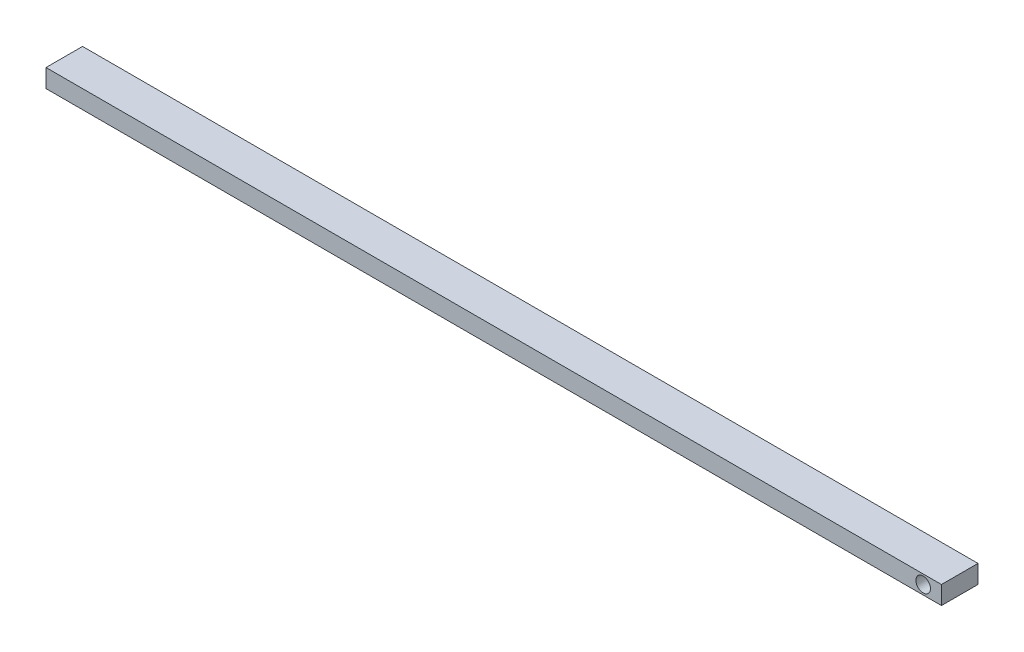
ISO-10303-21;
HEADER;
FILE_DESCRIPTION(('STEP AP214'),'2;1');
FILE_NAME('part.step','',(''),(''),'','','');
FILE_SCHEMA(('AUTOMOTIVE_DESIGN { 1 0 10303 214 1 1 1 1 }'));
ENDSEC;
DATA;
#1=APPLICATION_CONTEXT('core data for automotive mechanical design processes');
#2=APPLICATION_PROTOCOL_DEFINITION('international standard','automotive_design',2000,#1);
#3=PRODUCT_CONTEXT('',#1,'mechanical');
#4=PRODUCT('Part','Part','',(#3));
#5=PRODUCT_RELATED_PRODUCT_CATEGORY('part','',(#4));
#6=PRODUCT_DEFINITION_FORMATION('','',#4);
#7=PRODUCT_DEFINITION_CONTEXT('part definition',#1,'design');
#8=PRODUCT_DEFINITION('design','',#6,#7);
#9=PRODUCT_DEFINITION_SHAPE('','',#8);
#10=(LENGTH_UNIT() NAMED_UNIT(*) SI_UNIT(.MILLI.,.METRE.));
#11=(NAMED_UNIT(*) PLANE_ANGLE_UNIT() SI_UNIT($,.RADIAN.));
#12=(NAMED_UNIT(*) SI_UNIT($,.STERADIAN.) SOLID_ANGLE_UNIT());
#13=UNCERTAINTY_MEASURE_WITH_UNIT(LENGTH_MEASURE(1.E-05),#10,'distance_accuracy_value','');
#14=(GEOMETRIC_REPRESENTATION_CONTEXT(3) GLOBAL_UNCERTAINTY_ASSIGNED_CONTEXT((#13)) GLOBAL_UNIT_ASSIGNED_CONTEXT((#10,
#11,#12)) REPRESENTATION_CONTEXT('',''));
#15=CARTESIAN_POINT('',(0.,0.,0.));
#16=DIRECTION('',(0.,0.,1.));
#17=DIRECTION('',(1.,0.,0.));
#18=AXIS2_PLACEMENT_3D('',#15,#16,#17);
#19=CARTESIAN_POINT('',(0.,0.,20.));
#20=DIRECTION('',(1.,0.,0.));
#21=DIRECTION('',(0.,0.,-1.));
#22=AXIS2_PLACEMENT_3D('',#19,#20,#21);
#23=PLANE('',#22);
#24=CARTESIAN_POINT('',(0.,5.,10.));
#25=DIRECTION('',(-1.,0.,0.));
#26=DIRECTION('',(0.,0.,1.));
#27=AXIS2_PLACEMENT_3D('',#24,#25,#26);
#28=CIRCLE('',#27,4.75);
#29=CARTESIAN_POINT('',(0.,5.,14.75));
#30=VERTEX_POINT('',#29);
#31=EDGE_CURVE('E142',#30,#30,#28,.T.);
#32=ORIENTED_EDGE('',*,*,#31,.F.);
#33=EDGE_LOOP('',(#32));
#34=FACE_BOUND('',#33,.T.);
#35=DIRECTION('',(0.,-1.,0.));
#36=VECTOR('',#35,1.);
#37=CARTESIAN_POINT('',(0.,0.,0.));
#38=LINE('',#37,#36);
#39=CARTESIAN_POINT('',(0.,10.,0.));
#40=VERTEX_POINT('',#39);
#41=CARTESIAN_POINT('',(0.,0.,0.));
#42=VERTEX_POINT('',#41);
#43=EDGE_CURVE('E113',#40,#42,#38,.T.);
#44=ORIENTED_EDGE('',*,*,#43,.T.);
#45=DIRECTION('',(0.,0.,-1.));
#46=VECTOR('',#45,1.);
#47=CARTESIAN_POINT('',(0.,0.,20.));
#48=LINE('',#47,#46);
#49=CARTESIAN_POINT('',(0.,0.,20.));
#50=VERTEX_POINT('',#49);
#51=EDGE_CURVE('E11',#50,#42,#48,.T.);
#52=ORIENTED_EDGE('',*,*,#51,.F.);
#53=DIRECTION('',(0.,-1.,0.));
#54=VECTOR('',#53,1.);
#55=CARTESIAN_POINT('',(0.,0.,20.));
#56=LINE('',#55,#54);
#57=CARTESIAN_POINT('',(0.,10.,20.));
#58=VERTEX_POINT('',#57);
#59=EDGE_CURVE('E97',#58,#50,#56,.T.);
#60=ORIENTED_EDGE('',*,*,#59,.F.);
#61=DIRECTION('',(0.,0.,-1.));
#62=VECTOR('',#61,1.);
#63=CARTESIAN_POINT('',(0.,10.,20.));
#64=LINE('',#63,#62);
#65=EDGE_CURVE('E109',#58,#40,#64,.T.);
#66=ORIENTED_EDGE('',*,*,#65,.T.);
#67=EDGE_LOOP('',(#44,#52,#60,#66));
#68=FACE_BOUND('',#67,.T.);
#69=ADVANCED_FACE('F45',(#34,#68),#23,.F.);
#70=CARTESIAN_POINT('',(0.,0.,20.));
#71=DIRECTION('',(0.,1.,0.));
#72=DIRECTION('',(0.,0.,1.));
#73=AXIS2_PLACEMENT_3D('',#70,#71,#72);
#74=PLANE('',#73);
#75=DIRECTION('',(1.,0.,0.));
#76=VECTOR('',#75,1.);
#77=CARTESIAN_POINT('',(0.,0.,0.));
#78=LINE('',#77,#76);
#79=CARTESIAN_POINT('',(490.,0.,0.));
#80=VERTEX_POINT('',#79);
#81=EDGE_CURVE('E102',#42,#80,#78,.T.);
#82=ORIENTED_EDGE('',*,*,#81,.T.);
#83=DIRECTION('',(0.,0.,-1.));
#84=VECTOR('',#83,1.);
#85=CARTESIAN_POINT('',(490.,0.,20.));
#86=LINE('',#85,#84);
#87=CARTESIAN_POINT('',(490.,0.,20.));
#88=VERTEX_POINT('',#87);
#89=EDGE_CURVE('E54',#88,#80,#86,.T.);
#90=ORIENTED_EDGE('',*,*,#89,.F.);
#91=DIRECTION('',(1.,0.,0.));
#92=VECTOR('',#91,1.);
#93=CARTESIAN_POINT('',(0.,0.,20.));
#94=LINE('',#93,#92);
#95=EDGE_CURVE('E92',#50,#88,#94,.T.);
#96=ORIENTED_EDGE('',*,*,#95,.F.);
#97=ORIENTED_EDGE('',*,*,#51,.T.);
#98=EDGE_LOOP('',(#82,#90,#96,#97));
#99=FACE_BOUND('',#98,.T.);
#100=ADVANCED_FACE('F101',(#99),#74,.F.);
#101=CARTESIAN_POINT('',(490.,0.,20.));
#102=DIRECTION('',(-1.,0.,0.));
#103=DIRECTION('',(0.,0.,1.));
#104=AXIS2_PLACEMENT_3D('',#101,#102,#103);
#105=PLANE('',#104);
#106=DIRECTION('',(0.,1.,0.));
#107=VECTOR('',#106,1.);
#108=CARTESIAN_POINT('',(490.,0.,0.));
#109=LINE('',#108,#107);
#110=CARTESIAN_POINT('',(490.,10.,0.));
#111=VERTEX_POINT('',#110);
#112=EDGE_CURVE('E79',#80,#111,#109,.T.);
#113=ORIENTED_EDGE('',*,*,#112,.T.);
#114=DIRECTION('',(0.,0.,-1.));
#115=VECTOR('',#114,1.);
#116=CARTESIAN_POINT('',(490.,10.,20.));
#117=LINE('',#116,#115);
#118=CARTESIAN_POINT('',(490.,10.,20.));
#119=VERTEX_POINT('',#118);
#120=EDGE_CURVE('E104',#119,#111,#117,.T.);
#121=ORIENTED_EDGE('',*,*,#120,.F.);
#122=DIRECTION('',(0.,1.,0.));
#123=VECTOR('',#122,1.);
#124=CARTESIAN_POINT('',(490.,0.,20.));
#125=LINE('',#124,#123);
#126=EDGE_CURVE('E95',#88,#119,#125,.T.);
#127=ORIENTED_EDGE('',*,*,#126,.F.);
#128=ORIENTED_EDGE('',*,*,#89,.T.);
#129=EDGE_LOOP('',(#113,#121,#127,#128));
#130=FACE_BOUND('',#129,.T.);
#131=ADVANCED_FACE('F105',(#130),#105,.F.);
#132=CARTESIAN_POINT('',(0.,10.,20.));
#133=DIRECTION('',(0.,-1.,0.));
#134=DIRECTION('',(0.,0.,-1.));
#135=AXIS2_PLACEMENT_3D('',#132,#133,#134);
#136=PLANE('',#135);
#137=DIRECTION('',(-1.,0.,0.));
#138=VECTOR('',#137,1.);
#139=CARTESIAN_POINT('',(0.,10.,0.));
#140=LINE('',#139,#138);
#141=EDGE_CURVE('E85',#111,#40,#140,.T.);
#142=ORIENTED_EDGE('',*,*,#141,.T.);
#143=ORIENTED_EDGE('',*,*,#65,.F.);
#144=DIRECTION('',(-1.,0.,0.));
#145=VECTOR('',#144,1.);
#146=CARTESIAN_POINT('',(0.,10.,20.));
#147=LINE('',#146,#145);
#148=EDGE_CURVE('E62',#119,#58,#147,.T.);
#149=ORIENTED_EDGE('',*,*,#148,.F.);
#150=ORIENTED_EDGE('',*,*,#120,.T.);
#151=EDGE_LOOP('',(#142,#143,#149,#150));
#152=FACE_BOUND('',#151,.T.);
#153=ADVANCED_FACE('F127',(#152),#136,.F.);
#154=CARTESIAN_POINT('',(0.,0.,20.));
#155=DIRECTION('',(0.,0.,-1.));
#156=DIRECTION('',(-1.,0.,0.));
#157=AXIS2_PLACEMENT_3D('',#154,#155,#156);
#158=PLANE('',#157);
#159=CARTESIAN_POINT('',(480.,5.,20.));
#160=DIRECTION('',(0.,0.,1.));
#161=DIRECTION('',(1.,0.,0.));
#162=AXIS2_PLACEMENT_3D('',#159,#160,#161);
#163=CIRCLE('',#162,3.99999999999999);
#164=CARTESIAN_POINT('',(484.,5.,20.));
#165=VERTEX_POINT('',#164);
#166=EDGE_CURVE('E134',#165,#165,#163,.T.);
#167=ORIENTED_EDGE('',*,*,#166,.F.);
#168=EDGE_LOOP('',(#167));
#169=FACE_BOUND('',#168,.T.);
#170=ORIENTED_EDGE('',*,*,#59,.T.);
#171=ORIENTED_EDGE('',*,*,#95,.T.);
#172=ORIENTED_EDGE('',*,*,#126,.T.);
#173=ORIENTED_EDGE('',*,*,#148,.T.);
#174=EDGE_LOOP('',(#170,#171,#172,#173));
#175=FACE_BOUND('',#174,.T.);
#176=ADVANCED_FACE('F93',(#169,#175),#158,.F.);
#177=CARTESIAN_POINT('',(0.,0.,0.));
#178=DIRECTION('',(0.,0.,-1.));
#179=DIRECTION('',(-1.,0.,0.));
#180=AXIS2_PLACEMENT_3D('',#177,#178,#179);
#181=PLANE('',#180);
#182=CARTESIAN_POINT('',(480.,5.,0.));
#183=DIRECTION('',(0.,0.,1.));
#184=DIRECTION('',(1.,0.,0.));
#185=AXIS2_PLACEMENT_3D('',#182,#183,#184);
#186=CIRCLE('',#185,3.99999999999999);
#187=CARTESIAN_POINT('',(484.,5.,0.));
#188=VERTEX_POINT('',#187);
#189=EDGE_CURVE('E117',#188,#188,#186,.T.);
#190=ORIENTED_EDGE('',*,*,#189,.T.);
#191=EDGE_LOOP('',(#190));
#192=FACE_BOUND('',#191,.T.);
#193=ORIENTED_EDGE('',*,*,#43,.F.);
#194=ORIENTED_EDGE('',*,*,#141,.F.);
#195=ORIENTED_EDGE('',*,*,#112,.F.);
#196=ORIENTED_EDGE('',*,*,#81,.F.);
#197=EDGE_LOOP('',(#193,#194,#195,#196));
#198=FACE_BOUND('',#197,.T.);
#199=ADVANCED_FACE('F130',(#192,#198),#181,.T.);
#200=CARTESIAN_POINT('',(480.,5.,0.));
#201=DIRECTION('',(0.,0.,1.));
#202=DIRECTION('',(1.,0.,0.));
#203=AXIS2_PLACEMENT_3D('',#200,#201,#202);
#204=CYLINDRICAL_SURFACE('',#203,3.99999999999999);
#205=ORIENTED_EDGE('',*,*,#189,.F.);
#206=EDGE_LOOP('',(#205));
#207=FACE_BOUND('',#206,.T.);
#208=ORIENTED_EDGE('',*,*,#166,.T.);
#209=EDGE_LOOP('',(#208));
#210=FACE_BOUND('',#209,.T.);
#211=ADVANCED_FACE('F155',(#207,#210),#204,.F.);
#212=CARTESIAN_POINT('',(400.,5.,10.));
#213=DIRECTION('',(-1.,0.,0.));
#214=DIRECTION('',(0.,0.,1.));
#215=AXIS2_PLACEMENT_3D('',#212,#213,#214);
#216=CYLINDRICAL_SURFACE('',#215,4.75);
#217=CARTESIAN_POINT('',(400.,5.,10.));
#218=DIRECTION('',(-1.,0.,0.));
#219=DIRECTION('',(0.,0.,1.));
#220=AXIS2_PLACEMENT_3D('',#217,#218,#219);
#221=CIRCLE('',#220,4.75);
#222=CARTESIAN_POINT('',(400.,5.,14.75));
#223=VERTEX_POINT('',#222);
#224=EDGE_CURVE('E138',#223,#223,#221,.T.);
#225=ORIENTED_EDGE('',*,*,#224,.F.);
#226=EDGE_LOOP('',(#225));
#227=FACE_BOUND('',#226,.T.);
#228=ORIENTED_EDGE('',*,*,#31,.T.);
#229=EDGE_LOOP('',(#228));
#230=FACE_BOUND('',#229,.T.);
#231=ADVANCED_FACE('F152',(#227,#230),#216,.F.);
#232=CARTESIAN_POINT('',(400.,5.,10.));
#233=DIRECTION('',(-1.,0.,0.));
#234=DIRECTION('',(0.,0.,1.));
#235=AXIS2_PLACEMENT_3D('',#232,#233,#234);
#236=PLANE('',#235);
#237=ORIENTED_EDGE('',*,*,#224,.T.);
#238=EDGE_LOOP('',(#237));
#239=FACE_BOUND('',#238,.T.);
#240=ADVANCED_FACE('F150',(#239),#236,.T.);
#241=CLOSED_SHELL('',(#69,#100,#131,#153,#176,#199,#211,#231,#240));
#242=MANIFOLD_SOLID_BREP('B2',#241);
#243=ADVANCED_BREP_SHAPE_REPRESENTATION('',(#18,#242),#14);
#244=SHAPE_DEFINITION_REPRESENTATION(#9,#243);
ENDSEC;
END-ISO-10303-21;
